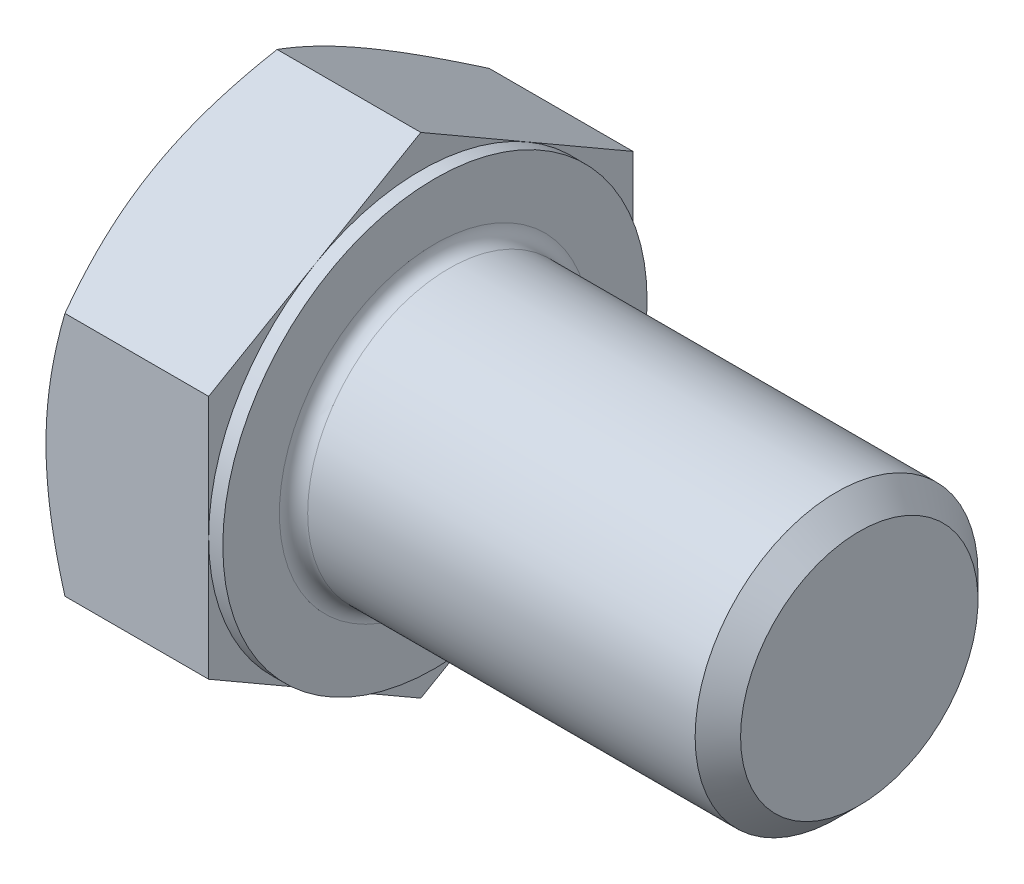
ISO-10303-21;
HEADER;
FILE_DESCRIPTION(('STEP AP214'),'2;1');
FILE_NAME('part.step','',(''),(''),'','','');
FILE_SCHEMA(('AUTOMOTIVE_DESIGN { 1 0 10303 214 1 1 1 1 }'));
ENDSEC;
DATA;
#1=APPLICATION_CONTEXT('core data for automotive mechanical design processes');
#2=APPLICATION_PROTOCOL_DEFINITION('international standard','automotive_design',2000,#1);
#3=PRODUCT_CONTEXT('',#1,'mechanical');
#4=PRODUCT('Part','Part','',(#3));
#5=PRODUCT_RELATED_PRODUCT_CATEGORY('part','',(#4));
#6=PRODUCT_DEFINITION_FORMATION('','',#4);
#7=PRODUCT_DEFINITION_CONTEXT('part definition',#1,'design');
#8=PRODUCT_DEFINITION('design','',#6,#7);
#9=PRODUCT_DEFINITION_SHAPE('','',#8);
#10=(LENGTH_UNIT() NAMED_UNIT(*) SI_UNIT(.MILLI.,.METRE.));
#11=(NAMED_UNIT(*) PLANE_ANGLE_UNIT() SI_UNIT($,.RADIAN.));
#12=(NAMED_UNIT(*) SI_UNIT($,.STERADIAN.) SOLID_ANGLE_UNIT());
#13=UNCERTAINTY_MEASURE_WITH_UNIT(LENGTH_MEASURE(1.E-05),#10,'distance_accuracy_value','');
#14=(GEOMETRIC_REPRESENTATION_CONTEXT(3) GLOBAL_UNCERTAINTY_ASSIGNED_CONTEXT((#13)) GLOBAL_UNIT_ASSIGNED_CONTEXT((#10,
#11,#12)) REPRESENTATION_CONTEXT('',''));
#15=CARTESIAN_POINT('',(0.,0.,0.));
#16=DIRECTION('',(0.,0.,1.));
#17=DIRECTION('',(1.,0.,0.));
#18=AXIS2_PLACEMENT_3D('',#15,#16,#17);
#19=CARTESIAN_POINT('',(7.5,0.,-18.));
#20=DIRECTION('',(1.,0.,0.));
#21=DIRECTION('',(0.,0.,-1.));
#22=AXIS2_PLACEMENT_3D('',#19,#20,#21);
#23=PLANE('',#22);
#24=CARTESIAN_POINT('',(7.5,0.,0.));
#25=DIRECTION('',(1.,0.,0.));
#26=DIRECTION('',(0.,0.,-1.));
#27=AXIS2_PLACEMENT_3D('',#24,#25,#26);
#28=CIRCLE('',#27,6.6);
#29=CARTESIAN_POINT('',(7.5,0.,-6.6));
#30=VERTEX_POINT('',#29);
#31=EDGE_CURVE('E44',#30,#30,#28,.F.);
#32=ORIENTED_EDGE('',*,*,#31,.T.);
#33=EDGE_LOOP('',(#32));
#34=FACE_BOUND('',#33,.T.);
#35=CARTESIAN_POINT('',(7.5,0.,0.));
#36=DIRECTION('',(1.,0.,0.));
#37=DIRECTION('',(0.,0.,-1.));
#38=AXIS2_PLACEMENT_3D('',#35,#36,#37);
#39=CIRCLE('',#38,9.);
#40=CARTESIAN_POINT('',(7.5,0.,-9.));
#41=VERTEX_POINT('',#40);
#42=EDGE_CURVE('E257',#41,#41,#39,.T.);
#43=ORIENTED_EDGE('',*,*,#42,.T.);
#44=EDGE_LOOP('',(#43));
#45=FACE_BOUND('',#44,.T.);
#46=ADVANCED_FACE('F35',(#34,#45),#23,.T.);
#47=CARTESIAN_POINT('',(0.,0.,0.));
#48=DIRECTION('',(-1.,0.,0.));
#49=DIRECTION('',(0.,0.,1.));
#50=AXIS2_PLACEMENT_3D('',#47,#48,#49);
#51=CYLINDRICAL_SURFACE('',#50,6.);
#52=CARTESIAN_POINT('',(8.1,0.,0.));
#53=DIRECTION('',(1.,0.,0.));
#54=DIRECTION('',(0.,0.,-1.));
#55=AXIS2_PLACEMENT_3D('',#52,#53,#54);
#56=CIRCLE('',#55,6.);
#57=CARTESIAN_POINT('',(8.1,0.,-6.));
#58=VERTEX_POINT('',#57);
#59=EDGE_CURVE('E11',#58,#58,#56,.T.);
#60=ORIENTED_EDGE('',*,*,#59,.T.);
#61=EDGE_LOOP('',(#60));
#62=FACE_BOUND('',#61,.T.);
#63=CARTESIAN_POINT('',(24.536,0.,0.));
#64=DIRECTION('',(-1.,0.,0.));
#65=DIRECTION('',(0.,0.,1.));
#66=AXIS2_PLACEMENT_3D('',#63,#64,#65);
#67=CIRCLE('',#66,6.);
#68=CARTESIAN_POINT('',(24.536,0.,6.));
#69=VERTEX_POINT('',#68);
#70=EDGE_CURVE('E301',#69,#69,#67,.T.);
#71=ORIENTED_EDGE('',*,*,#70,.T.);
#72=EDGE_LOOP('',(#71));
#73=FACE_BOUND('',#72,.T.);
#74=ADVANCED_FACE('F244',(#62,#73),#51,.T.);
#75=CARTESIAN_POINT('',(25.5,0.,0.));
#76=DIRECTION('',(-1.,0.,0.));
#77=DIRECTION('',(0.,0.,1.));
#78=AXIS2_PLACEMENT_3D('',#75,#76,#77);
#79=CONICAL_SURFACE('',#78,5.036,0.785398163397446);
#80=ORIENTED_EDGE('',*,*,#70,.F.);
#81=EDGE_LOOP('',(#80));
#82=FACE_BOUND('',#81,.T.);
#83=CARTESIAN_POINT('',(25.5,0.,0.));
#84=DIRECTION('',(-1.,0.,0.));
#85=DIRECTION('',(0.,0.,1.));
#86=AXIS2_PLACEMENT_3D('',#83,#84,#85);
#87=CIRCLE('',#86,5.036);
#88=CARTESIAN_POINT('',(25.5,0.,5.036));
#89=VERTEX_POINT('',#88);
#90=EDGE_CURVE('E303',#89,#89,#87,.T.);
#91=ORIENTED_EDGE('',*,*,#90,.T.);
#92=EDGE_LOOP('',(#91));
#93=FACE_BOUND('',#92,.T.);
#94=ADVANCED_FACE('F249',(#82,#93),#79,.T.);
#95=CARTESIAN_POINT('',(25.5,0.,0.));
#96=DIRECTION('',(-1.,0.,0.));
#97=DIRECTION('',(0.,0.,1.));
#98=AXIS2_PLACEMENT_3D('',#95,#96,#97);
#99=PLANE('',#98);
#100=ORIENTED_EDGE('',*,*,#90,.F.);
#101=EDGE_LOOP('',(#100));
#102=FACE_BOUND('',#101,.T.);
#103=ADVANCED_FACE('F350',(#102),#99,.F.);
#104=CARTESIAN_POINT('',(6.9,9.,0.));
#105=DIRECTION('',(1.,0.,0.));
#106=DIRECTION('',(0.,0.,-1.));
#107=AXIS2_PLACEMENT_3D('',#104,#105,#106);
#108=PLANE('',#107);
#109=DIRECTION('',(0.,0.500000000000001,0.866025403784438));
#110=VECTOR('',#109,1.);
#111=CARTESIAN_POINT('',(6.9,5.19615242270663,-9.));
#112=LINE('',#111,#110);
#113=CARTESIAN_POINT('',(6.9,5.19615242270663,-9.));
#114=VERTEX_POINT('',#113);
#115=CARTESIAN_POINT('',(6.9,7.79422863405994,-4.50000000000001));
#116=VERTEX_POINT('',#115);
#117=EDGE_CURVE('E168',#114,#116,#112,.T.);
#118=ORIENTED_EDGE('',*,*,#117,.T.);
#119=CARTESIAN_POINT('',(6.9,0.,0.));
#120=DIRECTION('',(-1.,0.,0.));
#121=DIRECTION('',(0.,0.,1.));
#122=AXIS2_PLACEMENT_3D('',#119,#120,#121);
#123=CIRCLE('',#122,9.);
#124=CARTESIAN_POINT('',(6.9,0.,-9.));
#125=VERTEX_POINT('',#124);
#126=EDGE_CURVE('E51',#116,#125,#123,.T.);
#127=ORIENTED_EDGE('',*,*,#126,.T.);
#128=DIRECTION('',(0.,1.,0.));
#129=VECTOR('',#128,1.);
#130=CARTESIAN_POINT('',(6.9,5.19615242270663,-9.));
#131=LINE('',#130,#129);
#132=EDGE_CURVE('E258',#125,#114,#131,.T.);
#133=ORIENTED_EDGE('',*,*,#132,.T.);
#134=EDGE_LOOP('',(#118,#127,#133));
#135=FACE_BOUND('',#134,.T.);
#136=ADVANCED_FACE('F280',(#135),#108,.T.);
#137=CARTESIAN_POINT('',(6.9,10.3923048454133,0.));
#138=VERTEX_POINT('',#137);
#139=EDGE_CURVE('E166',#116,#138,#112,.T.);
#140=ORIENTED_EDGE('',*,*,#139,.T.);
#141=DIRECTION('',(0.,-0.500000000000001,0.866025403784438));
#142=VECTOR('',#141,1.);
#143=CARTESIAN_POINT('',(6.9,10.3923048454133,0.));
#144=LINE('',#143,#142);
#145=CARTESIAN_POINT('',(6.9,7.79422863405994,4.50000000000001));
#146=VERTEX_POINT('',#145);
#147=EDGE_CURVE('E165',#138,#146,#144,.T.);
#148=ORIENTED_EDGE('',*,*,#147,.T.);
#149=EDGE_CURVE('E154',#146,#116,#123,.T.);
#150=ORIENTED_EDGE('',*,*,#149,.T.);
#151=EDGE_LOOP('',(#140,#148,#150));
#152=FACE_BOUND('',#151,.T.);
#153=ADVANCED_FACE('F287',(#152),#108,.T.);
#154=CARTESIAN_POINT('',(6.9,5.19615242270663,9.));
#155=VERTEX_POINT('',#154);
#156=EDGE_CURVE('E133',#146,#155,#144,.T.);
#157=ORIENTED_EDGE('',*,*,#156,.T.);
#158=DIRECTION('',(0.,-1.,0.));
#159=VECTOR('',#158,1.);
#160=CARTESIAN_POINT('',(6.9,5.19615242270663,9.));
#161=LINE('',#160,#159);
#162=CARTESIAN_POINT('',(6.9,0.,9.));
#163=VERTEX_POINT('',#162);
#164=EDGE_CURVE('E127',#155,#163,#161,.T.);
#165=ORIENTED_EDGE('',*,*,#164,.T.);
#166=EDGE_CURVE('E131',#163,#146,#123,.T.);
#167=ORIENTED_EDGE('',*,*,#166,.T.);
#168=EDGE_LOOP('',(#157,#165,#167));
#169=FACE_BOUND('',#168,.T.);
#170=ADVANCED_FACE('F129',(#169),#108,.T.);
#171=CARTESIAN_POINT('',(6.9,-5.19615242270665,9.));
#172=VERTEX_POINT('',#171);
#173=EDGE_CURVE('E137',#163,#172,#161,.T.);
#174=ORIENTED_EDGE('',*,*,#173,.T.);
#175=DIRECTION('',(0.,-0.500000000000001,-0.866025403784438));
#176=VECTOR('',#175,1.);
#177=CARTESIAN_POINT('',(6.9,-10.3923048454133,0.));
#178=LINE('',#177,#176);
#179=CARTESIAN_POINT('',(6.9,-7.79422863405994,4.50000000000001));
#180=VERTEX_POINT('',#179);
#181=EDGE_CURVE('E144',#172,#180,#178,.T.);
#182=ORIENTED_EDGE('',*,*,#181,.T.);
#183=EDGE_CURVE('E141',#180,#163,#123,.T.);
#184=ORIENTED_EDGE('',*,*,#183,.T.);
#185=EDGE_LOOP('',(#174,#182,#184));
#186=FACE_BOUND('',#185,.T.);
#187=ADVANCED_FACE('F142',(#186),#108,.T.);
#188=CARTESIAN_POINT('',(6.9,-10.3923048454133,0.));
#189=VERTEX_POINT('',#188);
#190=EDGE_CURVE('E160',#180,#189,#178,.T.);
#191=ORIENTED_EDGE('',*,*,#190,.T.);
#192=DIRECTION('',(0.,0.500000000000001,-0.866025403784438));
#193=VECTOR('',#192,1.);
#194=CARTESIAN_POINT('',(6.9,-5.19615242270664,-9.));
#195=LINE('',#194,#193);
#196=CARTESIAN_POINT('',(6.9,-7.79422863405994,-4.50000000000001));
#197=VERTEX_POINT('',#196);
#198=EDGE_CURVE('E341',#189,#197,#195,.T.);
#199=ORIENTED_EDGE('',*,*,#198,.T.);
#200=EDGE_CURVE('E148',#197,#180,#123,.T.);
#201=ORIENTED_EDGE('',*,*,#200,.T.);
#202=EDGE_LOOP('',(#191,#199,#201));
#203=FACE_BOUND('',#202,.T.);
#204=ADVANCED_FACE('F342',(#203),#108,.T.);
#205=CARTESIAN_POINT('',(6.9,-5.19615242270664,-9.));
#206=VERTEX_POINT('',#205);
#207=EDGE_CURVE('E155',#197,#206,#195,.T.);
#208=ORIENTED_EDGE('',*,*,#207,.T.);
#209=EDGE_CURVE('E261',#206,#125,#131,.T.);
#210=ORIENTED_EDGE('',*,*,#209,.T.);
#211=EDGE_CURVE('E273',#125,#197,#123,.T.);
#212=ORIENTED_EDGE('',*,*,#211,.T.);
#213=EDGE_LOOP('',(#208,#210,#212));
#214=FACE_BOUND('',#213,.T.);
#215=ADVANCED_FACE('F272',(#214),#108,.T.);
#216=CARTESIAN_POINT('',(0.,0.,0.));
#217=DIRECTION('',(-1.,0.,0.));
#218=DIRECTION('',(0.,0.,1.));
#219=AXIS2_PLACEMENT_3D('',#216,#217,#218);
#220=CYLINDRICAL_SURFACE('',#219,9.);
#221=ORIENTED_EDGE('',*,*,#126,.F.);
#222=ORIENTED_EDGE('',*,*,#149,.F.);
#223=ORIENTED_EDGE('',*,*,#166,.F.);
#224=ORIENTED_EDGE('',*,*,#183,.F.);
#225=ORIENTED_EDGE('',*,*,#200,.F.);
#226=ORIENTED_EDGE('',*,*,#211,.F.);
#227=EDGE_LOOP('',(#221,#222,#223,#224,#225,#226));
#228=FACE_BOUND('',#227,.T.);
#229=ORIENTED_EDGE('',*,*,#42,.F.);
#230=EDGE_LOOP('',(#229));
#231=FACE_BOUND('',#230,.T.);
#232=ADVANCED_FACE('F151',(#228,#231),#220,.T.);
#233=CARTESIAN_POINT('',(0.,0.,-18.));
#234=DIRECTION('',(1.,0.,0.));
#235=DIRECTION('',(0.,0.,-1.));
#236=AXIS2_PLACEMENT_3D('',#233,#234,#235);
#237=PLANE('',#236);
#238=CARTESIAN_POINT('',(0.,0.,0.));
#239=DIRECTION('',(1.,0.,0.));
#240=DIRECTION('',(0.,0.,-1.));
#241=AXIS2_PLACEMENT_3D('',#238,#239,#240);
#242=CIRCLE('',#241,9.);
#243=CARTESIAN_POINT('',(0.,0.,-9.));
#244=VERTEX_POINT('',#243);
#245=CARTESIAN_POINT('',(0.,7.79422863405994,-4.50000000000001));
#246=VERTEX_POINT('',#245);
#247=EDGE_CURVE('E259',#244,#246,#242,.T.);
#248=ORIENTED_EDGE('',*,*,#247,.F.);
#249=CARTESIAN_POINT('',(0.,-7.79422863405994,-4.50000000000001));
#250=VERTEX_POINT('',#249);
#251=EDGE_CURVE('E265',#250,#244,#242,.T.);
#252=ORIENTED_EDGE('',*,*,#251,.F.);
#253=CARTESIAN_POINT('',(0.,-7.79422863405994,4.50000000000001));
#254=VERTEX_POINT('',#253);
#255=EDGE_CURVE('E323',#254,#250,#242,.T.);
#256=ORIENTED_EDGE('',*,*,#255,.F.);
#257=CARTESIAN_POINT('',(0.,0.,9.));
#258=VERTEX_POINT('',#257);
#259=EDGE_CURVE('E319',#258,#254,#242,.T.);
#260=ORIENTED_EDGE('',*,*,#259,.F.);
#261=CARTESIAN_POINT('',(0.,0.,0.));
#262=DIRECTION('',(-1.,0.,0.));
#263=DIRECTION('',(0.,0.,1.));
#264=AXIS2_PLACEMENT_3D('',#261,#262,#263);
#265=CIRCLE('',#264,9.);
#266=CARTESIAN_POINT('',(0.,7.79422863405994,4.50000000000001));
#267=VERTEX_POINT('',#266);
#268=EDGE_CURVE('E169',#258,#267,#265,.T.);
#269=ORIENTED_EDGE('',*,*,#268,.T.);
#270=EDGE_CURVE('E263',#246,#267,#242,.T.);
#271=ORIENTED_EDGE('',*,*,#270,.F.);
#272=EDGE_LOOP('',(#248,#252,#256,#260,#269,#271));
#273=FACE_BOUND('',#272,.T.);
#274=ADVANCED_FACE('F320',(#273),#237,.F.);
#275=CARTESIAN_POINT('',(0.,0.,0.));
#276=DIRECTION('',(1.,0.,0.));
#277=DIRECTION('',(0.,0.,-1.));
#278=AXIS2_PLACEMENT_3D('',#275,#276,#277);
#279=CONICAL_SURFACE('',#278,9.,1.0471975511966);
#280=CARTESIAN_POINT('',(0.803914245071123,5.19603695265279,9.0002));
#281=CARTESIAN_POINT('',(0.737982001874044,5.31024090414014,8.80239295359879));
#282=CARTESIAN_POINT('',(0.675041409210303,5.42489028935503,8.60381439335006));
#283=CARTESIAN_POINT('',(0.555968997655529,5.65512011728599,8.20504463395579));
#284=CARTESIAN_POINT('',(0.499840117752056,5.77070093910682,8.00485277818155));
#285=CARTESIAN_POINT('',(0.395151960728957,6.00300811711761,7.60248494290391));
#286=CARTESIAN_POINT('',(0.346610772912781,6.11973652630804,7.40030540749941));
#287=CARTESIAN_POINT('',(0.258148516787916,6.35398725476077,6.99457124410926));
#288=CARTESIAN_POINT('',(0.218225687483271,6.47150940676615,6.7910169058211));
#289=CARTESIAN_POINT('',(0.148684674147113,6.70436794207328,6.38769409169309));
#290=CARTESIAN_POINT('',(0.118837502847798,6.81968712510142,6.187955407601));
#291=CARTESIAN_POINT('',(0.0687933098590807,7.05084147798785,5.78758432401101));
#292=CARTESIAN_POINT('',(0.04859543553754,7.16667660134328,5.5869520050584));
#293=CARTESIAN_POINT('',(0.0183543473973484,7.39854776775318,5.18533936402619));
#294=CARTESIAN_POINT('',(0.00829960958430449,7.51458343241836,4.98435969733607));
#295=CARTESIAN_POINT('',(-0.00143766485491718,7.74676155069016,4.58221540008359));
#296=CARTESIAN_POINT('',(-0.00112052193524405,7.86290400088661,4.38105077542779));
#297=CARTESIAN_POINT('',(0.00916395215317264,8.08003584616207,4.00496738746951));
#298=CARTESIAN_POINT('',(0.0178767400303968,8.18104055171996,3.83002210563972));
#299=CARTESIAN_POINT('',(0.0429773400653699,8.38281337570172,3.48054132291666));
#300=CARTESIAN_POINT('',(0.0593656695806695,8.4835814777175,3.30600585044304));
#301=CARTESIAN_POINT('',(0.11965655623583,8.7854956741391,2.7830751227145));
#302=CARTESIAN_POINT('',(0.174677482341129,8.98610736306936,2.43560548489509));
#303=CARTESIAN_POINT('',(0.312230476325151,9.38945876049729,1.73698037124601));
#304=CARTESIAN_POINT('',(0.395345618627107,9.59214699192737,1.38591405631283));
#305=CARTESIAN_POINT('',(0.583982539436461,9.99450087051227,0.689016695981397));
#306=CARTESIAN_POINT('',(0.689460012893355,10.1941716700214,0.343176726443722));
#307=CARTESIAN_POINT('',(0.803914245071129,10.3924203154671,-0.000200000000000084));
#308=B_SPLINE_CURVE_WITH_KNOTS('',3,(#280,#281,#282,#283,#284,#285,#286,#287,#288,#289,#290,
#291,#292,#293,#294,#295,#296,#297,#298,#299,#300,#301,#302,#303,#304,#305,#306,#307),
.UNSPECIFIED.,.F.,.F.,(4,2,2,2,2,2,2,2,2,2,2,2,2,4),(0.,0.713219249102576,1.42674513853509,
2.14194697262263,2.8570025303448,3.55449749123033,4.25193080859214,4.94857085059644,
5.64518936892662,6.25162976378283,6.8581110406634,8.07193747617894,9.31268391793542,
10.5509947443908),.UNSPECIFIED.);
#309=CARTESIAN_POINT('',(0.803847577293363,10.3923048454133,0.));
#310=VERTEX_POINT('',#309);
#311=EDGE_CURVE('E215',#267,#310,#308,.T.);
#312=ORIENTED_EDGE('',*,*,#311,.T.);
#313=CARTESIAN_POINT('',(0.803914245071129,10.3924203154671,0.000200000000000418));
#314=CARTESIAN_POINT('',(0.737982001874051,10.2782163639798,-0.197607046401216));
#315=CARTESIAN_POINT('',(0.675041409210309,10.1635669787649,-0.396185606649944));
#316=CARTESIAN_POINT('',(0.555968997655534,9.93333715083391,-0.794955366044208));
#317=CARTESIAN_POINT('',(0.499840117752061,9.81775632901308,-0.995147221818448));
#318=CARTESIAN_POINT('',(0.395151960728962,9.58544915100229,-1.39751505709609));
#319=CARTESIAN_POINT('',(0.346610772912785,9.46872074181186,-1.59969459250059));
#320=CARTESIAN_POINT('',(0.25814851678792,9.23447001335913,-2.00542875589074));
#321=CARTESIAN_POINT('',(0.218225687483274,9.11694786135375,-2.20898309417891));
#322=CARTESIAN_POINT('',(0.148684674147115,8.88408932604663,-2.61230590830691));
#323=CARTESIAN_POINT('',(0.1188375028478,8.76877014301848,-2.812044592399));
#324=CARTESIAN_POINT('',(0.0687933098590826,8.53761579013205,-3.21241567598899));
#325=CARTESIAN_POINT('',(0.0485954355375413,8.42178066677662,-3.4130479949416));
#326=CARTESIAN_POINT('',(0.0183543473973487,8.18990950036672,-3.81466063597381));
#327=CARTESIAN_POINT('',(0.0082996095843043,8.07387383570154,-4.01564030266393));
#328=CARTESIAN_POINT('',(-0.00143766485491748,7.84169571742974,-4.41778459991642));
#329=CARTESIAN_POINT('',(-0.00112052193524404,7.72555326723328,-4.61894922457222));
#330=CARTESIAN_POINT('',(0.00916395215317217,7.50842142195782,-4.9950326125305));
#331=CARTESIAN_POINT('',(0.0178767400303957,7.40741671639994,-5.16997789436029));
#332=CARTESIAN_POINT('',(0.0429773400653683,7.20564389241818,-5.51945867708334));
#333=CARTESIAN_POINT('',(0.0593656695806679,7.1048757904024,-5.69399414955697));
#334=CARTESIAN_POINT('',(0.119656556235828,6.8029615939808,-6.2169248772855));
#335=CARTESIAN_POINT('',(0.174677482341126,6.60234990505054,-6.56439451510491));
#336=CARTESIAN_POINT('',(0.312230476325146,6.19899850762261,-7.263019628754));
#337=CARTESIAN_POINT('',(0.395345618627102,5.99631027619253,-7.61408594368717));
#338=CARTESIAN_POINT('',(0.583982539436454,5.59395639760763,-8.3109833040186));
#339=CARTESIAN_POINT('',(0.689460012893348,5.39428559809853,-8.65682327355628));
#340=CARTESIAN_POINT('',(0.803914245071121,5.19603695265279,-9.0002));
#341=B_SPLINE_CURVE_WITH_KNOTS('',3,(#313,#314,#315,#316,#317,#318,#319,#320,#321,#322,#323,
#324,#325,#326,#327,#328,#329,#330,#331,#332,#333,#334,#335,#336,#337,#338,#339,#340),
.UNSPECIFIED.,.F.,.F.,(4,2,2,2,2,2,2,2,2,2,2,2,2,4),(0.,0.713219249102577,1.42674513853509,
2.14194697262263,2.8570025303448,3.55449749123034,4.25193080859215,4.94857085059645,
5.64518936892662,6.25162976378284,6.8581110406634,8.07193747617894,9.31268391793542,
10.5509947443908),.UNSPECIFIED.);
#342=EDGE_CURVE('E59',#310,#246,#341,.T.);
#343=ORIENTED_EDGE('',*,*,#342,.T.);
#344=ORIENTED_EDGE('',*,*,#270,.T.);
#345=EDGE_LOOP('',(#312,#343,#344));
#346=FACE_BOUND('',#345,.T.);
#347=ADVANCED_FACE('F317',(#346),#279,.T.);
#348=CARTESIAN_POINT('',(4.50308345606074,-14.1853984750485,9.00000000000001));
#349=CARTESIAN_POINT('',(4.31054430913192,-13.7903499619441,9.00000000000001));
#350=CARTESIAN_POINT('',(4.11978648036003,-13.3944187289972,9.00000000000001));
#351=CARTESIAN_POINT('',(3.74283091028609,-12.6003222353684,9.00000000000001));
#352=CARTESIAN_POINT('',(3.55663384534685,-12.2021566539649,9.00000000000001));
#353=CARTESIAN_POINT('',(3.18890856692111,-11.4011784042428,9.00000000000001));
#354=CARTESIAN_POINT('',(3.00740939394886,-10.998352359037,9.00000000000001));
#355=CARTESIAN_POINT('',(2.65153988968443,-10.1895752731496,9.00000000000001));
#356=CARTESIAN_POINT('',(2.47716923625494,-9.78362437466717,9.));
#357=CARTESIAN_POINT('',(2.13161245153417,-8.95398189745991,9.));
#358=CARTESIAN_POINT('',(1.96074001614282,-8.53015895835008,9.));
#359=CARTESIAN_POINT('',(1.63138410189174,-7.67764040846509,9.));
#360=CARTESIAN_POINT('',(1.47290198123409,-7.2489442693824,9.));
#361=CARTESIAN_POINT('',(1.17232155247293,-6.38672363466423,9.));
#362=CARTESIAN_POINT('',(1.0301919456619,-5.95321016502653,9.));
#363=CARTESIAN_POINT('',(0.766724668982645,-5.07998336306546,9.));
#364=CARTESIAN_POINT('',(0.645380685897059,-4.64027195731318,9.));
#365=CARTESIAN_POINT('',(0.429822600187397,-3.75682505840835,9.));
#366=CARTESIAN_POINT('',(0.335452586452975,-3.31312863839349,9.));
#367=CARTESIAN_POINT('',(0.218090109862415,-2.64336713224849,9.));
#368=CARTESIAN_POINT('',(0.182999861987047,-2.41939560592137,9.));
#369=CARTESIAN_POINT('',(0.121565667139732,-1.97026354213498,9.));
#370=CARTESIAN_POINT('',(0.0952208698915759,-1.74510312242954,9.));
#371=CARTESIAN_POINT('',(0.052145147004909,-1.29693480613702,9.));
#372=CARTESIAN_POINT('',(0.0352889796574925,-1.07393899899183,9.));
#373=CARTESIAN_POINT('',(0.0110310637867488,-0.627433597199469,9.));
#374=CARTESIAN_POINT('',(0.00362915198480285,-0.403924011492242,9.));
#375=CARTESIAN_POINT('',(-0.00154262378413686,0.0432079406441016,9.));
#376=CARTESIAN_POINT('',(0.000687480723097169,0.266830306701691,9.));
#377=CARTESIAN_POINT('',(0.01472260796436,0.713776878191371,9.));
#378=CARTESIAN_POINT('',(0.0265280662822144,0.937101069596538,9.));
#379=CARTESIAN_POINT('',(0.0656502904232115,1.46707212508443,9.));
#380=CARTESIAN_POINT('',(0.0971347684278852,1.77341845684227,9.));
#381=CARTESIAN_POINT('',(0.176454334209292,2.38397028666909,9.));
#382=CARTESIAN_POINT('',(0.224291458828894,2.68817551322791,9.));
#383=CARTESIAN_POINT('',(0.389806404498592,3.59715813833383,9.));
#384=CARTESIAN_POINT('',(0.529461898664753,4.19799413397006,9.));
#385=CARTESIAN_POINT('',(0.773331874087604,5.09670707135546,9.));
#386=CARTESIAN_POINT('',(0.861532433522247,5.39919911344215,9.));
#387=CARTESIAN_POINT('',(1.04752099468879,6.00125026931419,9.));
#388=CARTESIAN_POINT('',(1.14530906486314,6.30080936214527,9.));
#389=CARTESIAN_POINT('',(1.34886866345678,6.89708059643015,9.));
#390=CARTESIAN_POINT('',(1.45463788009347,7.19379353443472,9.));
#391=CARTESIAN_POINT('',(1.67287302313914,7.78473288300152,9.));
#392=CARTESIAN_POINT('',(1.78533883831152,8.07895933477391,9.));
#393=CARTESIAN_POINT('',(2.07523735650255,8.81619445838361,9.));
#394=CARTESIAN_POINT('',(2.25629467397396,9.25777585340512,9.));
#395=CARTESIAN_POINT('',(2.62827522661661,10.136777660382,9.));
#396=CARTESIAN_POINT('',(2.81919929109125,10.5741977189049,9.));
#397=CARTESIAN_POINT('',(3.20877963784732,11.445728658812,9.));
#398=CARTESIAN_POINT('',(3.40743823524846,11.8798385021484,9.));
#399=CARTESIAN_POINT('',(3.81079737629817,12.7452179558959,9.));
#400=CARTESIAN_POINT('',(4.01549773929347,13.1764876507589,9.));
#401=CARTESIAN_POINT('',(4.43000777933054,14.0372827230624,9.));
#402=CARTESIAN_POINT('',(4.63982402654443,14.4668049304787,9.));
#403=CARTESIAN_POINT('',(5.06336871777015,15.3239162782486,9.));
#404=CARTESIAN_POINT('',(5.27709718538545,15.7515054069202,9.));
#405=CARTESIAN_POINT('',(5.70771290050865,16.6049951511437,9.));
#406=CARTESIAN_POINT('',(5.9245995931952,17.0308960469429,9.));
#407=CARTESIAN_POINT('',(6.36101693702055,17.8813418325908,9.));
#408=CARTESIAN_POINT('',(6.58054759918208,18.3058867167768,9.));
#409=CARTESIAN_POINT('',(7.20096689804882,19.4981240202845,9.));
#410=CARTESIAN_POINT('',(7.60436223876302,20.2645118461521,9.));
#411=CARTESIAN_POINT('',(8.41646748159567,21.794506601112,9.));
#412=CARTESIAN_POINT('',(8.82517763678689,22.558113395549,9.));
#413=CARTESIAN_POINT('',(9.64538992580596,24.0808854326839,9.));
#414=CARTESIAN_POINT('',(10.0568800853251,24.8400571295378,9.));
#415=CARTESIAN_POINT('',(10.6764233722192,25.977523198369,9.));
#416=CARTESIAN_POINT('',(10.883315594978,26.3564507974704,9.));
#417=CARTESIAN_POINT('',(11.2977907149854,27.113927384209,9.));
#418=CARTESIAN_POINT('',(11.505373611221,27.4924763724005,9.));
#419=CARTESIAN_POINT('',(11.713260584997,27.8708583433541,9.));
#420=B_SPLINE_CURVE_WITH_KNOTS('',3,(#348,#349,#350,#351,#352,#353,#354,#355,#356,#357,#358,
#359,#360,#361,#362,#363,#364,#365,#366,#367,#368,#369,#370,#371,#372,#373,#374,#375,#376,#377,
#378,#379,#380,#381,#382,#383,#384,#385,#386,#387,#388,#389,#390,#391,#392,#393,#394,#395,#396,
#397,#398,#399,#400,#401,#402,#403,#404,#405,#406,#407,#408,#409,#410,#411,#412,#413,#414,#415,
#416,#417,#418,#419),.UNSPECIFIED.,.F.,.F.,(4,2,2,2,2,2,2,2,2,2,2,2,2,2,2,2,2,2,2,2,2,2,2,2,2,2,
2,2,2,2,2,2,2,2,2,4),(0.,1.3184276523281,2.63704965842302,3.96247407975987,5.28783853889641,
6.65860359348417,8.02951869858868,9.39776461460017,10.7655942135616,12.1253499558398,
12.8053173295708,13.4852185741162,14.1559216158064,14.8266130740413,15.497302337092,
16.1680221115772,17.0913849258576,18.0148627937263,19.8627426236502,20.8079230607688,
21.7531102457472,22.6980246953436,23.6429234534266,25.0745302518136,26.506257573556,
27.9384167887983,29.3705332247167,30.804597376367,32.2386701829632,33.6724940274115,
35.1063238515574,37.7045032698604,40.3028068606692,42.8933552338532,44.1885437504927,
45.4837303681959),.UNSPECIFIED.);
#421=CARTESIAN_POINT('',(0.803847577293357,5.19615242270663,9.));
#422=VERTEX_POINT('',#421);
#423=EDGE_CURVE('E227',#258,#422,#420,.T.);
#424=ORIENTED_EDGE('',*,*,#423,.T.);
#425=EDGE_CURVE('E226',#422,#267,#308,.T.);
#426=ORIENTED_EDGE('',*,*,#425,.T.);
#427=ORIENTED_EDGE('',*,*,#268,.F.);
#428=EDGE_LOOP('',(#424,#426,#427));
#429=FACE_BOUND('',#428,.T.);
#430=ADVANCED_FACE('F314',(#429),#279,.T.);
#431=CARTESIAN_POINT('',(0.803847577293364,-5.19615242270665,9.));
#432=VERTEX_POINT('',#431);
#433=EDGE_CURVE('E305',#432,#258,#420,.T.);
#434=ORIENTED_EDGE('',*,*,#433,.T.);
#435=ORIENTED_EDGE('',*,*,#259,.T.);
#436=CARTESIAN_POINT('',(0.803914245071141,-10.3924203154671,-0.00019999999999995));
#437=CARTESIAN_POINT('',(0.737982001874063,-10.2782163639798,0.197607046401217));
#438=CARTESIAN_POINT('',(0.675041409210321,-10.1635669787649,0.396185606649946));
#439=CARTESIAN_POINT('',(0.555968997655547,-9.93333715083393,0.794955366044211));
#440=CARTESIAN_POINT('',(0.499840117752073,-9.8177563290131,0.995147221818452));
#441=CARTESIAN_POINT('',(0.395151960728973,-9.58544915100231,1.3975150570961));
#442=CARTESIAN_POINT('',(0.346610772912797,-9.46872074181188,1.5996945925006));
#443=CARTESIAN_POINT('',(0.258148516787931,-9.23447001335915,2.00542875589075));
#444=CARTESIAN_POINT('',(0.218225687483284,-9.11694786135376,2.20898309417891));
#445=CARTESIAN_POINT('',(0.148684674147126,-8.88408932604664,2.61230590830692));
#446=CARTESIAN_POINT('',(0.118837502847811,-8.76877014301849,2.81204459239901));
#447=CARTESIAN_POINT('',(0.0687933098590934,-8.53761579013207,3.212415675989));
#448=CARTESIAN_POINT('',(0.0485954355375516,-8.42178066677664,3.41304799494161));
#449=CARTESIAN_POINT('',(0.0183543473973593,-8.18990950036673,3.81466063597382));
#450=CARTESIAN_POINT('',(0.00829960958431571,-8.07387383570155,4.01564030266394));
#451=CARTESIAN_POINT('',(-0.00143766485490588,-7.84169571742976,4.41778459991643));
#452=CARTESIAN_POINT('',(-0.00112052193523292,-7.7255532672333,4.61894922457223));
#453=CARTESIAN_POINT('',(0.00916395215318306,-7.50842142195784,4.99503261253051));
#454=CARTESIAN_POINT('',(0.0178767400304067,-7.40741671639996,5.1699778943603));
#455=CARTESIAN_POINT('',(0.0429773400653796,-7.2056438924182,5.51945867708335));
#456=CARTESIAN_POINT('',(0.0593656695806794,-7.10487579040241,5.69399414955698));
#457=CARTESIAN_POINT('',(0.119656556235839,-6.80296159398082,6.21692487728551));
#458=CARTESIAN_POINT('',(0.174677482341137,-6.60234990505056,6.56439451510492));
#459=CARTESIAN_POINT('',(0.312230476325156,-6.19899850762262,7.263019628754));
#460=CARTESIAN_POINT('',(0.395345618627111,-5.99631027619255,7.61408594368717));
#461=CARTESIAN_POINT('',(0.583982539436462,-5.59395639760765,8.31098330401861));
#462=CARTESIAN_POINT('',(0.689460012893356,-5.39428559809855,8.65682327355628));
#463=CARTESIAN_POINT('',(0.803914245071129,-5.19603695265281,9.0002));
#464=B_SPLINE_CURVE_WITH_KNOTS('',3,(#436,#437,#438,#439,#440,#441,#442,#443,#444,#445,#446,
#447,#448,#449,#450,#451,#452,#453,#454,#455,#456,#457,#458,#459,#460,#461,#462,#463),
.UNSPECIFIED.,.F.,.F.,(4,2,2,2,2,2,2,2,2,2,2,2,2,4),(0.,0.713219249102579,1.42674513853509,
2.14194697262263,2.85700253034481,3.55449749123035,4.25193080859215,4.94857085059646,
5.64518936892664,6.25162976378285,6.85811104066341,8.07193747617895,9.31268391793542,
10.5509947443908),.UNSPECIFIED.);
#465=EDGE_CURVE('E217',#254,#432,#464,.T.);
#466=ORIENTED_EDGE('',*,*,#465,.T.);
#467=EDGE_LOOP('',(#434,#435,#466));
#468=FACE_BOUND('',#467,.T.);
#469=ADVANCED_FACE('F187',(#468),#279,.T.);
#470=CARTESIAN_POINT('',(0.803847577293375,-10.3923048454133,0.));
#471=VERTEX_POINT('',#470);
#472=EDGE_CURVE('E210',#471,#254,#464,.T.);
#473=ORIENTED_EDGE('',*,*,#472,.T.);
#474=ORIENTED_EDGE('',*,*,#255,.T.);
#475=CARTESIAN_POINT('',(0.803914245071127,-5.19603695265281,-9.0002));
#476=CARTESIAN_POINT('',(0.737982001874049,-5.31024090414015,-8.80239295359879));
#477=CARTESIAN_POINT('',(0.675041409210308,-5.42489028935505,-8.60381439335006));
#478=CARTESIAN_POINT('',(0.555968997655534,-5.65512011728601,-8.20504463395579));
#479=CARTESIAN_POINT('',(0.49984011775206,-5.77070093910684,-8.00485277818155));
#480=CARTESIAN_POINT('',(0.395151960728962,-6.00300811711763,-7.6024849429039));
#481=CARTESIAN_POINT('',(0.346610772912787,-6.11973652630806,-7.40030540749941));
#482=CARTESIAN_POINT('',(0.258148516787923,-6.35398725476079,-6.99457124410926));
#483=CARTESIAN_POINT('',(0.218225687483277,-6.47150940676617,-6.79101690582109));
#484=CARTESIAN_POINT('',(0.148684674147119,-6.7043679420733,-6.38769409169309));
#485=CARTESIAN_POINT('',(0.118837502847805,-6.81968712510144,-6.187955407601));
#486=CARTESIAN_POINT('',(0.0687933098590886,-7.05084147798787,-5.78758432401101));
#487=CARTESIAN_POINT('',(0.0485954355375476,-7.1666766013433,-5.5869520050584));
#488=CARTESIAN_POINT('',(0.0183543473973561,-7.3985477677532,-5.18533936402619));
#489=CARTESIAN_POINT('',(0.0082996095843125,-7.51458343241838,-4.98435969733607));
#490=CARTESIAN_POINT('',(-0.00143766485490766,-7.74676155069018,-4.58221540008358));
#491=CARTESIAN_POINT('',(-0.00112052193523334,-7.86290400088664,-4.38105077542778));
#492=CARTESIAN_POINT('',(0.00916395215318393,-8.0800358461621,-4.0049673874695));
#493=CARTESIAN_POINT('',(0.0178767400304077,-8.18104055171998,-3.83002210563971));
#494=CARTESIAN_POINT('',(0.0429773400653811,-8.38281337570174,-3.48054132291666));
#495=CARTESIAN_POINT('',(0.0593656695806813,-8.48358147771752,-3.30600585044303));
#496=CARTESIAN_POINT('',(0.119656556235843,-8.78549567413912,-2.7830751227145));
#497=CARTESIAN_POINT('',(0.17467748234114,-8.98610736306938,-2.43560548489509));
#498=CARTESIAN_POINT('',(0.312230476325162,-9.38945876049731,-1.736980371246));
#499=CARTESIAN_POINT('',(0.395345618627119,-9.59214699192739,-1.38591405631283));
#500=CARTESIAN_POINT('',(0.583982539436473,-9.99450087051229,-0.689016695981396));
#501=CARTESIAN_POINT('',(0.689460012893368,-10.1941716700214,-0.343176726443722));
#502=CARTESIAN_POINT('',(0.803914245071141,-10.3924203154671,0.000200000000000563));
#503=B_SPLINE_CURVE_WITH_KNOTS('',3,(#475,#476,#477,#478,#479,#480,#481,#482,#483,#484,#485,
#486,#487,#488,#489,#490,#491,#492,#493,#494,#495,#496,#497,#498,#499,#500,#501,#502),
.UNSPECIFIED.,.F.,.F.,(4,2,2,2,2,2,2,2,2,2,2,2,2,4),(0.,0.713219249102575,1.42674513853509,
2.14194697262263,2.8570025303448,3.55449749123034,4.25193080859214,4.94857085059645,
5.64518936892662,6.25162976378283,6.8581110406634,8.07193747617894,9.31268391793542,
10.5509947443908),.UNSPECIFIED.);
#504=EDGE_CURVE('E216',#250,#471,#503,.T.);
#505=ORIENTED_EDGE('',*,*,#504,.T.);
#506=EDGE_LOOP('',(#473,#474,#505));
#507=FACE_BOUND('',#506,.T.);
#508=ADVANCED_FACE('F337',(#507),#279,.T.);
#509=CARTESIAN_POINT('',(0.803847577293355,5.19615242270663,-9.));
#510=VERTEX_POINT('',#509);
#511=EDGE_CURVE('E218',#246,#510,#341,.T.);
#512=ORIENTED_EDGE('',*,*,#511,.T.);
#513=CARTESIAN_POINT('',(4.50308345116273,-14.1853984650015,-9.));
#514=CARTESIAN_POINT('',(4.3105443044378,-13.7903499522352,-9.));
#515=CARTESIAN_POINT('',(4.1197864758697,-13.3944187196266,-9.));
#516=CARTESIAN_POINT('',(3.74283090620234,-12.6003222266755,-9.));
#517=CARTESIAN_POINT('',(3.55663384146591,-12.2021566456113,-9.));
#518=CARTESIAN_POINT('',(3.18890856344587,-11.4011783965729,-9.));
#519=CARTESIAN_POINT('',(3.00740939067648,-10.9983523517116,-9.));
#520=CARTESIAN_POINT('',(2.65153988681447,-10.1895752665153,-9.));
#521=CARTESIAN_POINT('',(2.47716923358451,-9.78362436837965,-9.));
#522=CARTESIAN_POINT('',(2.1316124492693,-8.95398189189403,-9.));
#523=CARTESIAN_POINT('',(1.96074001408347,-8.53015895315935,-9.));
#524=CARTESIAN_POINT('',(1.63138410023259,-7.67764040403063,-9.));
#525=CARTESIAN_POINT('',(1.47290197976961,-7.24894426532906,-9.));
#526=CARTESIAN_POINT('',(1.17232155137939,-6.38672363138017,-9.));
#527=CARTESIAN_POINT('',(1.0301919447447,-5.95321016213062,-9.));
#528=CARTESIAN_POINT('',(0.766724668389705,-5.07998336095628,-9.));
#529=CARTESIAN_POINT('',(0.645380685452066,-4.64027195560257,-9.));
#530=CARTESIAN_POINT('',(0.42982260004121,-3.756825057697,-9.));
#531=CARTESIAN_POINT('',(0.335452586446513,-3.3131286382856,-9.));
#532=CARTESIAN_POINT('',(0.218090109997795,-2.64336713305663,-9.));
#533=CARTESIAN_POINT('',(0.182999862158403,-2.41939560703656,-9.));
#534=CARTESIAN_POINT('',(0.121565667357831,-1.97026354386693,-9.));
#535=CARTESIAN_POINT('',(0.0952208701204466,-1.74510312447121,-9.));
#536=CARTESIAN_POINT('',(0.0521451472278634,-1.29693480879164,-9.));
#537=CARTESIAN_POINT('',(0.0352889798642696,-1.07393900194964,-9.));
#538=CARTESIAN_POINT('',(0.0110310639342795,-0.627433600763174,-9.));
#539=CARTESIAN_POINT('',(0.00362915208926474,-0.403924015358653,-9.));
#540=CARTESIAN_POINT('',(-0.001542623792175,0.0432079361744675,-9.));
#541=CARTESIAN_POINT('',(0.000687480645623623,0.266830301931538,-9.));
#542=CARTESIAN_POINT('',(0.014722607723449,0.71377687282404,-9.));
#543=CARTESIAN_POINT('',(0.0265280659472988,0.937101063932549,-9.));
#544=CARTESIAN_POINT('',(0.0656502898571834,1.46707211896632,-9.));
#545=CARTESIAN_POINT('',(0.0971347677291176,1.77341845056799,-9.));
#546=CARTESIAN_POINT('',(0.176454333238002,2.38397028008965,-9.));
#547=CARTESIAN_POINT('',(0.224291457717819,2.68817550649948,-9.));
#548=CARTESIAN_POINT('',(0.389806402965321,3.59715813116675,-9.));
#549=CARTESIAN_POINT('',(0.529461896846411,4.19799412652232,-9.));
#550=CARTESIAN_POINT('',(0.773331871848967,5.09670706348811,-9.));
#551=CARTESIAN_POINT('',(0.861532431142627,5.39919910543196,-9.));
#552=CARTESIAN_POINT('',(1.04752099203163,6.00125026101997,-9.));
#553=CARTESIAN_POINT('',(1.14530906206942,6.30080935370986,-9.));
#554=CARTESIAN_POINT('',(1.34886866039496,6.89708058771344,-9.));
#555=CARTESIAN_POINT('',(1.45463787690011,7.1937935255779,-9.));
#556=CARTESIAN_POINT('',(1.6728730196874,7.78473287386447,-9.));
#557=CARTESIAN_POINT('',(1.78533883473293,8.07895932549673,-9.));
#558=CARTESIAN_POINT('',(2.07523735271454,8.81619444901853,-9.));
#559=CARTESIAN_POINT('',(2.25629467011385,9.257775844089,-9.));
#560=CARTESIAN_POINT('',(2.62827522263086,10.1367776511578,-9.));
#561=CARTESIAN_POINT('',(2.81919928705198,10.5741977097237,-9.));
#562=CARTESIAN_POINT('',(3.20877963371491,11.4457286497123,-9.));
#563=CARTESIAN_POINT('',(3.40743823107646,11.8798384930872,-9.));
#564=CARTESIAN_POINT('',(3.81079737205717,12.7452179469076,-9.));
#565=CARTESIAN_POINT('',(4.01549773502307,13.1764876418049,-9.));
#566=CARTESIAN_POINT('',(4.43000777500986,14.0372827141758,-9.));
#567=CARTESIAN_POINT('',(4.63982402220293,14.466804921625,-9.));
#568=CARTESIAN_POINT('',(5.06336871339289,15.3239162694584,-9.));
#569=CARTESIAN_POINT('',(5.27709718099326,15.7515053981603,-9.));
#570=CARTESIAN_POINT('',(5.707712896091,16.6049951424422,-9.));
#571=CARTESIAN_POINT('',(5.92459958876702,17.0308960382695,-9.));
#572=CARTESIAN_POINT('',(6.36101693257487,17.8813418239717,-9.));
#573=CARTESIAN_POINT('',(6.58054759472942,18.305886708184,-9.));
#574=CARTESIAN_POINT('',(7.20096689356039,19.4981240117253,-9.));
#575=CARTESIAN_POINT('',(7.60436223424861,20.2645118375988,-9.));
#576=CARTESIAN_POINT('',(8.41646747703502,21.7945065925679,-9.));
#577=CARTESIAN_POINT('',(8.82517763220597,22.558113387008,-9.));
#578=CARTESIAN_POINT('',(9.64538992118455,24.0808854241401,-9.));
#579=CARTESIAN_POINT('',(10.0568800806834,24.8400571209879,-9.));
#580=CARTESIAN_POINT('',(10.6764233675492,25.9775231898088,-9.));
#581=CARTESIAN_POINT('',(10.8833155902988,26.3564507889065,-9.));
#582=CARTESIAN_POINT('',(11.2977907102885,27.1139273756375,-9.));
#583=CARTESIAN_POINT('',(11.5053736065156,27.492476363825,-9.));
#584=CARTESIAN_POINT('',(11.7132605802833,27.8708583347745,-9.));
#585=B_SPLINE_CURVE_WITH_KNOTS('',3,(#513,#514,#515,#516,#517,#518,#519,#520,#521,#522,#523,
#524,#525,#526,#527,#528,#529,#530,#531,#532,#533,#534,#535,#536,#537,#538,#539,#540,#541,#542,
#543,#544,#545,#546,#547,#548,#549,#550,#551,#552,#553,#554,#555,#556,#557,#558,#559,#560,#561,
#562,#563,#564,#565,#566,#567,#568,#569,#570,#571,#572,#573,#574,#575,#576,#577,#578,#579,#580,
#581,#582,#583,#584),.UNSPECIFIED.,.F.,.F.,(4,2,2,2,2,2,2,2,2,2,2,2,2,2,2,2,2,2,2,2,2,2,2,2,2,2,
2,2,2,2,2,2,2,2,2,4),(0.,1.31842765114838,2.6370496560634,3.96247407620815,5.28783853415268,
6.65860358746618,8.02951869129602,9.39776460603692,10.7655942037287,12.1253499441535,
12.8053173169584,13.4852185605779,14.1559216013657,14.8266130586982,15.4973023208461,
16.1680220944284,17.0913849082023,18.0148627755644,19.862742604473,20.8079230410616,
21.7531102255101,22.6980246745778,23.6429234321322,25.0745302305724,26.5062575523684,
27.9384167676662,29.3705332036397,30.8045973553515,32.2386701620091,33.6724940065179,
35.1063238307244,37.7045032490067,40.3028068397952,42.8933552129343,44.1885437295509,
45.4837303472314),.UNSPECIFIED.);
#586=EDGE_CURVE('E180',#510,#244,#585,.F.);
#587=ORIENTED_EDGE('',*,*,#586,.T.);
#588=ORIENTED_EDGE('',*,*,#247,.T.);
#589=EDGE_LOOP('',(#512,#587,#588));
#590=FACE_BOUND('',#589,.T.);
#591=ADVANCED_FACE('F334',(#590),#279,.T.);
#592=CARTESIAN_POINT('',(0.803847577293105,-5.19615242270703,-9.));
#593=VERTEX_POINT('',#592);
#594=EDGE_CURVE('E181',#593,#250,#503,.T.);
#595=ORIENTED_EDGE('',*,*,#594,.T.);
#596=ORIENTED_EDGE('',*,*,#251,.T.);
#597=EDGE_CURVE('E172',#244,#593,#585,.F.);
#598=ORIENTED_EDGE('',*,*,#597,.T.);
#599=EDGE_LOOP('',(#595,#596,#598));
#600=FACE_BOUND('',#599,.T.);
#601=ADVANCED_FACE('F196',(#600),#279,.T.);
#602=CARTESIAN_POINT('',(7.5,5.19615242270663,-9.));
#603=DIRECTION('',(0.,0.,1.));
#604=DIRECTION('',(1.,0.,0.));
#605=AXIS2_PLACEMENT_3D('',#602,#603,#604);
#606=PLANE('',#605);
#607=ORIENTED_EDGE('',*,*,#209,.F.);
#608=DIRECTION('',(-1.,0.,0.));
#609=VECTOR('',#608,1.);
#610=CARTESIAN_POINT('',(7.5,-5.19615242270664,-9.));
#611=LINE('',#610,#609);
#612=EDGE_CURVE('E298',#206,#593,#611,.T.);
#613=ORIENTED_EDGE('',*,*,#612,.T.);
#614=ORIENTED_EDGE('',*,*,#597,.F.);
#615=ORIENTED_EDGE('',*,*,#586,.F.);
#616=DIRECTION('',(-1.,0.,0.));
#617=VECTOR('',#616,1.);
#618=CARTESIAN_POINT('',(7.5,5.19615242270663,-9.));
#619=LINE('',#618,#617);
#620=EDGE_CURVE('E278',#114,#510,#619,.T.);
#621=ORIENTED_EDGE('',*,*,#620,.F.);
#622=ORIENTED_EDGE('',*,*,#132,.F.);
#623=EDGE_LOOP('',(#607,#613,#614,#615,#621,#622));
#624=FACE_BOUND('',#623,.T.);
#625=ADVANCED_FACE('F191',(#624),#606,.F.);
#626=CARTESIAN_POINT('',(7.5,-5.19615242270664,-9.));
#627=DIRECTION('',(0.,0.866025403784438,0.500000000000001));
#628=DIRECTION('',(0.,-0.500000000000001,0.866025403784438));
#629=AXIS2_PLACEMENT_3D('',#626,#627,#628);
#630=PLANE('',#629);
#631=ORIENTED_EDGE('',*,*,#198,.F.);
#632=DIRECTION('',(-1.,0.,0.));
#633=VECTOR('',#632,1.);
#634=CARTESIAN_POINT('',(7.5,-10.3923048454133,0.));
#635=LINE('',#634,#633);
#636=EDGE_CURVE('E294',#189,#471,#635,.T.);
#637=ORIENTED_EDGE('',*,*,#636,.T.);
#638=ORIENTED_EDGE('',*,*,#504,.F.);
#639=ORIENTED_EDGE('',*,*,#594,.F.);
#640=ORIENTED_EDGE('',*,*,#612,.F.);
#641=ORIENTED_EDGE('',*,*,#207,.F.);
#642=EDGE_LOOP('',(#631,#637,#638,#639,#640,#641));
#643=FACE_BOUND('',#642,.T.);
#644=ADVANCED_FACE('F195',(#643),#630,.F.);
#645=CARTESIAN_POINT('',(7.5,-10.3923048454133,0.));
#646=DIRECTION('',(0.,0.866025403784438,-0.500000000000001));
#647=DIRECTION('',(0.,0.500000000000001,0.866025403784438));
#648=AXIS2_PLACEMENT_3D('',#645,#646,#647);
#649=PLANE('',#648);
#650=ORIENTED_EDGE('',*,*,#181,.F.);
#651=DIRECTION('',(-1.,0.,0.));
#652=VECTOR('',#651,1.);
#653=CARTESIAN_POINT('',(7.5,-5.19615242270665,9.));
#654=LINE('',#653,#652);
#655=EDGE_CURVE('E159',#172,#432,#654,.T.);
#656=ORIENTED_EDGE('',*,*,#655,.T.);
#657=ORIENTED_EDGE('',*,*,#465,.F.);
#658=ORIENTED_EDGE('',*,*,#472,.F.);
#659=ORIENTED_EDGE('',*,*,#636,.F.);
#660=ORIENTED_EDGE('',*,*,#190,.F.);
#661=EDGE_LOOP('',(#650,#656,#657,#658,#659,#660));
#662=FACE_BOUND('',#661,.T.);
#663=ADVANCED_FACE('F202',(#662),#649,.F.);
#664=CARTESIAN_POINT('',(7.5,5.19615242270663,9.));
#665=DIRECTION('',(0.,0.,-1.));
#666=DIRECTION('',(0.,1.,0.));
#667=AXIS2_PLACEMENT_3D('',#664,#665,#666);
#668=PLANE('',#667);
#669=ORIENTED_EDGE('',*,*,#164,.F.);
#670=DIRECTION('',(-1.,0.,0.));
#671=VECTOR('',#670,1.);
#672=CARTESIAN_POINT('',(7.5,5.19615242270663,9.));
#673=LINE('',#672,#671);
#674=EDGE_CURVE('E290',#155,#422,#673,.T.);
#675=ORIENTED_EDGE('',*,*,#674,.T.);
#676=ORIENTED_EDGE('',*,*,#423,.F.);
#677=ORIENTED_EDGE('',*,*,#433,.F.);
#678=ORIENTED_EDGE('',*,*,#655,.F.);
#679=ORIENTED_EDGE('',*,*,#173,.F.);
#680=EDGE_LOOP('',(#669,#675,#676,#677,#678,#679));
#681=FACE_BOUND('',#680,.T.);
#682=ADVANCED_FACE('F157',(#681),#668,.F.);
#683=CARTESIAN_POINT('',(7.5,10.3923048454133,0.));
#684=DIRECTION('',(0.,-0.866025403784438,-0.500000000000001));
#685=DIRECTION('',(0.,0.500000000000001,-0.866025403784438));
#686=AXIS2_PLACEMENT_3D('',#683,#684,#685);
#687=PLANE('',#686);
#688=ORIENTED_EDGE('',*,*,#147,.F.);
#689=DIRECTION('',(-1.,0.,0.));
#690=VECTOR('',#689,1.);
#691=CARTESIAN_POINT('',(7.5,10.3923048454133,0.));
#692=LINE('',#691,#690);
#693=EDGE_CURVE('E285',#138,#310,#692,.T.);
#694=ORIENTED_EDGE('',*,*,#693,.T.);
#695=ORIENTED_EDGE('',*,*,#311,.F.);
#696=ORIENTED_EDGE('',*,*,#425,.F.);
#697=ORIENTED_EDGE('',*,*,#674,.F.);
#698=ORIENTED_EDGE('',*,*,#156,.F.);
#699=EDGE_LOOP('',(#688,#694,#695,#696,#697,#698));
#700=FACE_BOUND('',#699,.T.);
#701=ADVANCED_FACE('F232',(#700),#687,.F.);
#702=CARTESIAN_POINT('',(7.5,5.19615242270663,-9.));
#703=DIRECTION('',(0.,-0.866025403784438,0.500000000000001));
#704=DIRECTION('',(0.,-0.500000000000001,-0.866025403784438));
#705=AXIS2_PLACEMENT_3D('',#702,#703,#704);
#706=PLANE('',#705);
#707=ORIENTED_EDGE('',*,*,#117,.F.);
#708=ORIENTED_EDGE('',*,*,#620,.T.);
#709=ORIENTED_EDGE('',*,*,#511,.F.);
#710=ORIENTED_EDGE('',*,*,#342,.F.);
#711=ORIENTED_EDGE('',*,*,#693,.F.);
#712=ORIENTED_EDGE('',*,*,#139,.F.);
#713=EDGE_LOOP('',(#707,#708,#709,#710,#711,#712));
#714=FACE_BOUND('',#713,.T.);
#715=ADVANCED_FACE('F37',(#714),#706,.F.);
#716=CARTESIAN_POINT('',(8.1,0.,0.));
#717=DIRECTION('',(1.,0.,0.));
#718=DIRECTION('',(0.,0.,-1.));
#719=AXIS2_PLACEMENT_3D('',#716,#717,#718);
#720=TOROIDAL_SURFACE('',#719,6.6,0.6);
#721=ORIENTED_EDGE('',*,*,#59,.F.);
#722=EDGE_LOOP('',(#721));
#723=FACE_BOUND('',#722,.T.);
#724=ORIENTED_EDGE('',*,*,#31,.F.);
#725=EDGE_LOOP('',(#724));
#726=FACE_BOUND('',#725,.T.);
#727=ADVANCED_FACE('F240',(#723,#726),#720,.F.);
#728=CLOSED_SHELL('',(#46,#74,#94,#103,#136,#153,#170,#187,#204,#215,#232,#274,#347,#430,#469,
#508,#591,#601,#625,#644,#663,#682,#701,#715,#727));
#729=MANIFOLD_SOLID_BREP('B2',#728);
#730=ADVANCED_BREP_SHAPE_REPRESENTATION('',(#18,#729),#14);
#731=SHAPE_DEFINITION_REPRESENTATION(#9,#730);
ENDSEC;
END-ISO-10303-21;
